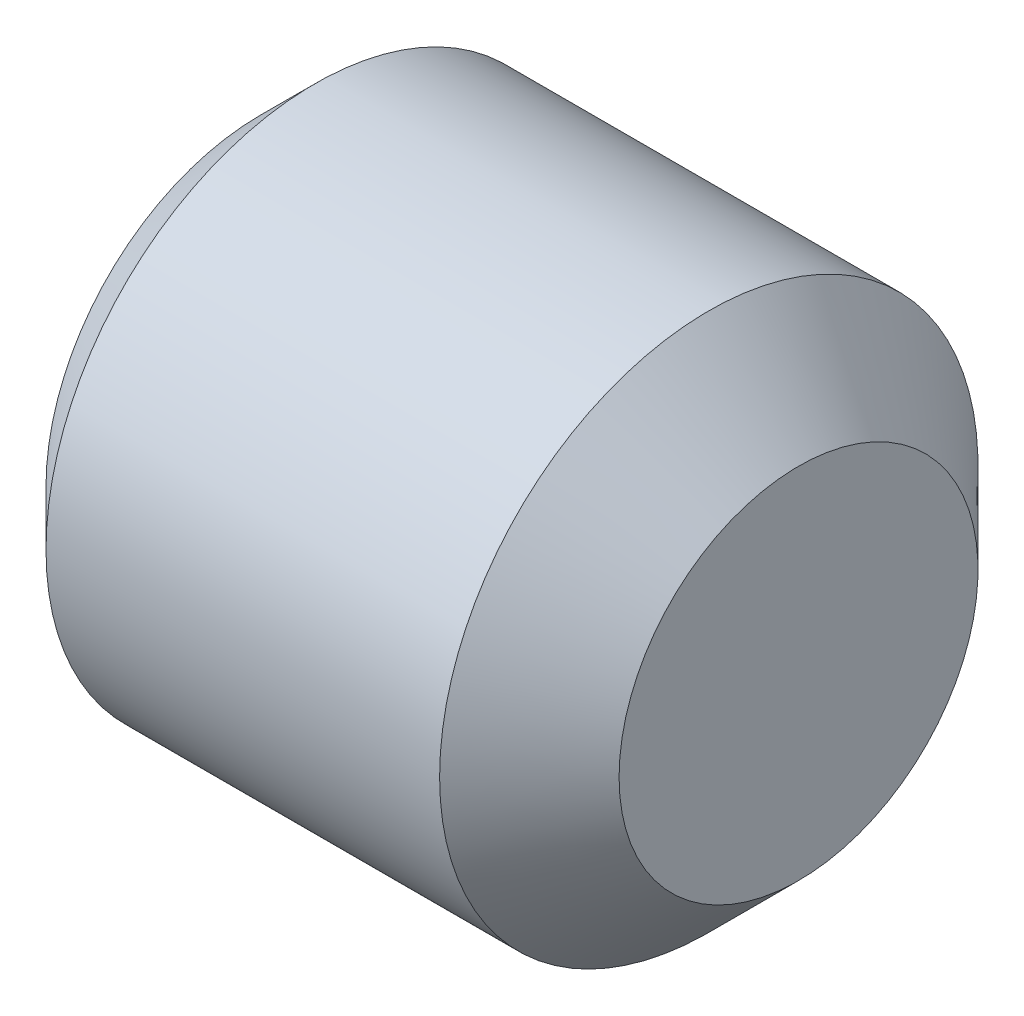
ISO-10303-21;
HEADER;
FILE_DESCRIPTION(('STEP AP214'),'2;1');
FILE_NAME('part.step','',(''),(''),'','','');
FILE_SCHEMA(('AUTOMOTIVE_DESIGN { 1 0 10303 214 1 1 1 1 }'));
ENDSEC;
DATA;
#1=APPLICATION_CONTEXT('core data for automotive mechanical design processes');
#2=APPLICATION_PROTOCOL_DEFINITION('international standard','automotive_design',2000,#1);
#3=PRODUCT_CONTEXT('',#1,'mechanical');
#4=PRODUCT('Part','Part','',(#3));
#5=PRODUCT_RELATED_PRODUCT_CATEGORY('part','',(#4));
#6=PRODUCT_DEFINITION_FORMATION('','',#4);
#7=PRODUCT_DEFINITION_CONTEXT('part definition',#1,'design');
#8=PRODUCT_DEFINITION('design','',#6,#7);
#9=PRODUCT_DEFINITION_SHAPE('','',#8);
#10=(LENGTH_UNIT() NAMED_UNIT(*) SI_UNIT(.MILLI.,.METRE.));
#11=(NAMED_UNIT(*) PLANE_ANGLE_UNIT() SI_UNIT($,.RADIAN.));
#12=(NAMED_UNIT(*) SI_UNIT($,.STERADIAN.) SOLID_ANGLE_UNIT());
#13=UNCERTAINTY_MEASURE_WITH_UNIT(LENGTH_MEASURE(1.E-05),#10,'distance_accuracy_value','');
#14=(GEOMETRIC_REPRESENTATION_CONTEXT(3) GLOBAL_UNCERTAINTY_ASSIGNED_CONTEXT((#13)) GLOBAL_UNIT_ASSIGNED_CONTEXT((#10,
#11,#12)) REPRESENTATION_CONTEXT('',''));
#15=CARTESIAN_POINT('',(0.,0.,0.));
#16=DIRECTION('',(0.,0.,1.));
#17=DIRECTION('',(1.,0.,0.));
#18=AXIS2_PLACEMENT_3D('',#15,#16,#17);
#19=CARTESIAN_POINT('',(-4.,0.,0.));
#20=DIRECTION('',(-1.,0.,0.));
#21=DIRECTION('',(0.,0.,1.));
#22=AXIS2_PLACEMENT_3D('',#19,#20,#21);
#23=PLANE('',#22);
#24=CARTESIAN_POINT('',(-4.00000000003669,0.,0.));
#25=DIRECTION('',(-1.,0.,0.));
#26=DIRECTION('',(0.,0.,1.));
#27=AXIS2_PLACEMENT_3D('',#24,#25,#26);
#28=CIRCLE('',#27,1.50000000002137);
#29=CARTESIAN_POINT('',(-4.00000000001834,-1.50000000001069,0.));
#30=VERTEX_POINT('',#29);
#31=CARTESIAN_POINT('',(-4.00000000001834,-0.750000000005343,-1.29903810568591));
#32=VERTEX_POINT('',#31);
#33=EDGE_CURVE('E100',#30,#32,#28,.F.);
#34=ORIENTED_EDGE('',*,*,#33,.T.);
#35=DIRECTION('',(0.,0.866025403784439,-0.5));
#36=VECTOR('',#35,1.);
#37=CARTESIAN_POINT('',(-4.,0.,-1.73205080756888));
#38=LINE('',#37,#36);
#39=CARTESIAN_POINT('',(-4.,-1.5,-0.86602540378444));
#40=VERTEX_POINT('',#39);
#41=EDGE_CURVE('E125',#32,#40,#38,.F.);
#42=ORIENTED_EDGE('',*,*,#41,.T.);
#43=DIRECTION('',(0.,0.,-1.));
#44=VECTOR('',#43,1.);
#45=CARTESIAN_POINT('',(-4.,-1.5,-0.866025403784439));
#46=LINE('',#45,#44);
#47=EDGE_CURVE('E128',#40,#30,#46,.F.);
#48=ORIENTED_EDGE('',*,*,#47,.T.);
#49=EDGE_LOOP('',(#34,#42,#48));
#50=FACE_BOUND('',#49,.T.);
#51=ADVANCED_FACE('F16',(#50),#23,.T.);
#52=CARTESIAN_POINT('',(-4.,0.,0.));
#53=DIRECTION('',(-1.,0.,0.));
#54=DIRECTION('',(0.,0.,1.));
#55=AXIS2_PLACEMENT_3D('',#52,#53,#54);
#56=PLANE('',#55);
#57=CARTESIAN_POINT('',(-4.00000000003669,0.,0.));
#58=DIRECTION('',(-1.,0.,0.));
#59=DIRECTION('',(0.,0.,1.));
#60=AXIS2_PLACEMENT_3D('',#57,#58,#59);
#61=CIRCLE('',#60,1.50000000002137);
#62=CARTESIAN_POINT('',(-4.00000000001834,0.750000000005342,-1.29903810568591));
#63=VERTEX_POINT('',#62);
#64=EDGE_CURVE('E121',#32,#63,#61,.F.);
#65=ORIENTED_EDGE('',*,*,#64,.T.);
#66=DIRECTION('',(0.,0.866025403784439,0.5));
#67=VECTOR('',#66,1.);
#68=CARTESIAN_POINT('',(-4.,1.5,-0.866025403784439));
#69=LINE('',#68,#67);
#70=CARTESIAN_POINT('',(-4.,0.,-1.73205080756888));
#71=VERTEX_POINT('',#70);
#72=EDGE_CURVE('E181',#63,#71,#69,.F.);
#73=ORIENTED_EDGE('',*,*,#72,.T.);
#74=DIRECTION('',(0.,0.866025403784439,-0.5));
#75=VECTOR('',#74,1.);
#76=CARTESIAN_POINT('',(-4.,0.,-1.73205080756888));
#77=LINE('',#76,#75);
#78=EDGE_CURVE('E133',#71,#32,#77,.F.);
#79=ORIENTED_EDGE('',*,*,#78,.T.);
#80=EDGE_LOOP('',(#65,#73,#79));
#81=FACE_BOUND('',#80,.T.);
#82=ADVANCED_FACE('F380',(#81),#56,.T.);
#83=CARTESIAN_POINT('',(-4.,0.,-1.73205080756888));
#84=DIRECTION('',(0.,-0.5,-0.866025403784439));
#85=DIRECTION('',(0.,0.866025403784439,-0.5));
#86=AXIS2_PLACEMENT_3D('',#83,#84,#85);
#87=PLANE('',#86);
#88=DIRECTION('',(1.,0.,0.));
#89=VECTOR('',#88,1.);
#90=CARTESIAN_POINT('',(-4.,-1.5,-0.866025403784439));
#91=LINE('',#90,#89);
#92=CARTESIAN_POINT('',(-6.,-1.5,-0.86602540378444));
#93=VERTEX_POINT('',#92);
#94=EDGE_CURVE('E136',#93,#40,#91,.T.);
#95=ORIENTED_EDGE('',*,*,#94,.T.);
#96=ORIENTED_EDGE('',*,*,#41,.F.);
#97=ORIENTED_EDGE('',*,*,#78,.F.);
#98=DIRECTION('',(1.,0.,0.));
#99=VECTOR('',#98,1.);
#100=CARTESIAN_POINT('',(-4.,0.,-1.73205080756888));
#101=LINE('',#100,#99);
#102=CARTESIAN_POINT('',(-6.,0.,-1.73205080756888));
#103=VERTEX_POINT('',#102);
#104=EDGE_CURVE('E149',#71,#103,#101,.F.);
#105=ORIENTED_EDGE('',*,*,#104,.T.);
#106=DIRECTION('',(0.,0.866025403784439,-0.5));
#107=VECTOR('',#106,1.);
#108=CARTESIAN_POINT('',(-6.,0.,-1.73205080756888));
#109=LINE('',#108,#107);
#110=EDGE_CURVE('E137',#93,#103,#109,.T.);
#111=ORIENTED_EDGE('',*,*,#110,.F.);
#112=EDGE_LOOP('',(#95,#96,#97,#105,#111));
#113=FACE_BOUND('',#112,.T.);
#114=ADVANCED_FACE('F131',(#113),#87,.F.);
#115=CARTESIAN_POINT('',(-4.,-1.5,-0.866025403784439));
#116=DIRECTION('',(0.,-1.,0.));
#117=DIRECTION('',(0.,0.,-1.));
#118=AXIS2_PLACEMENT_3D('',#115,#116,#117);
#119=PLANE('',#118);
#120=DIRECTION('',(1.,0.,0.));
#121=VECTOR('',#120,1.);
#122=CARTESIAN_POINT('',(-4.,-1.5,0.866025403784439));
#123=LINE('',#122,#121);
#124=CARTESIAN_POINT('',(-6.,-1.5,0.866025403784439));
#125=VERTEX_POINT('',#124);
#126=CARTESIAN_POINT('',(-4.,-1.5,0.866025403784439));
#127=VERTEX_POINT('',#126);
#128=EDGE_CURVE('E90',#125,#127,#123,.T.);
#129=ORIENTED_EDGE('',*,*,#128,.T.);
#130=DIRECTION('',(0.,0.,1.));
#131=VECTOR('',#130,1.);
#132=CARTESIAN_POINT('',(-4.,-1.5,0.));
#133=LINE('',#132,#131);
#134=EDGE_CURVE('E88',#30,#127,#133,.T.);
#135=ORIENTED_EDGE('',*,*,#134,.F.);
#136=ORIENTED_EDGE('',*,*,#47,.F.);
#137=ORIENTED_EDGE('',*,*,#94,.F.);
#138=DIRECTION('',(0.,0.,-1.));
#139=VECTOR('',#138,1.);
#140=CARTESIAN_POINT('',(-6.,-1.5,-0.866025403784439));
#141=LINE('',#140,#139);
#142=EDGE_CURVE('E195',#125,#93,#141,.T.);
#143=ORIENTED_EDGE('',*,*,#142,.F.);
#144=EDGE_LOOP('',(#129,#135,#136,#137,#143));
#145=FACE_BOUND('',#144,.T.);
#146=ADVANCED_FACE('F240',(#145),#119,.F.);
#147=CARTESIAN_POINT('',(-4.,0.,0.));
#148=DIRECTION('',(-1.,0.,0.));
#149=DIRECTION('',(0.,0.,1.));
#150=AXIS2_PLACEMENT_3D('',#147,#148,#149);
#151=PLANE('',#150);
#152=CARTESIAN_POINT('',(-4.00000000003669,0.,0.));
#153=DIRECTION('',(-1.,0.,0.));
#154=DIRECTION('',(0.,0.,1.));
#155=AXIS2_PLACEMENT_3D('',#152,#153,#154);
#156=CIRCLE('',#155,1.50000000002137);
#157=CARTESIAN_POINT('',(-4.00000000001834,-0.750000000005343,1.29903810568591));
#158=VERTEX_POINT('',#157);
#159=EDGE_CURVE('E19',#158,#30,#156,.F.);
#160=ORIENTED_EDGE('',*,*,#159,.T.);
#161=ORIENTED_EDGE('',*,*,#134,.T.);
#162=DIRECTION('',(0.,-0.866025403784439,-0.5));
#163=VECTOR('',#162,1.);
#164=CARTESIAN_POINT('',(-4.,-1.5,0.866025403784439));
#165=LINE('',#164,#163);
#166=EDGE_CURVE('E83',#127,#158,#165,.F.);
#167=ORIENTED_EDGE('',*,*,#166,.T.);
#168=EDGE_LOOP('',(#160,#161,#167));
#169=FACE_BOUND('',#168,.T.);
#170=ADVANCED_FACE('F85',(#169),#151,.T.);
#171=CARTESIAN_POINT('',(-3.99999999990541,0.,0.));
#172=DIRECTION('',(-1.,0.,0.));
#173=DIRECTION('',(0.,0.,1.));
#174=AXIS2_PLACEMENT_3D('',#171,#172,#173);
#175=CONICAL_SURFACE('',#174,1.499999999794,1.04719755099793);
#176=CARTESIAN_POINT('',(-3.13397459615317,0.,-1.13686837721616E-10));
#177=VERTEX_POINT('',#176);
#178=VERTEX_LOOP('',#177);
#179=FACE_BOUND('',#178,.T.);
#180=CARTESIAN_POINT('',(-4.00000000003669,0.,0.));
#181=DIRECTION('',(-1.,0.,0.));
#182=DIRECTION('',(0.,0.,1.));
#183=AXIS2_PLACEMENT_3D('',#180,#181,#182);
#184=CIRCLE('',#183,1.50000000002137);
#185=CARTESIAN_POINT('',(-4.00000000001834,1.50000000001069,0.));
#186=VERTEX_POINT('',#185);
#187=EDGE_CURVE('E117',#63,#186,#184,.F.);
#188=ORIENTED_EDGE('',*,*,#187,.F.);
#189=ORIENTED_EDGE('',*,*,#64,.F.);
#190=ORIENTED_EDGE('',*,*,#33,.F.);
#191=ORIENTED_EDGE('',*,*,#159,.F.);
#192=CARTESIAN_POINT('',(-4.00000000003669,0.,0.));
#193=DIRECTION('',(-1.,0.,0.));
#194=DIRECTION('',(0.,0.,1.));
#195=AXIS2_PLACEMENT_3D('',#192,#193,#194);
#196=CIRCLE('',#195,1.50000000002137);
#197=CARTESIAN_POINT('',(-4.00000000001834,0.750000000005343,1.29903810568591));
#198=VERTEX_POINT('',#197);
#199=EDGE_CURVE('E96',#198,#158,#196,.F.);
#200=ORIENTED_EDGE('',*,*,#199,.F.);
#201=CARTESIAN_POINT('',(-4.00000000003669,0.,0.));
#202=DIRECTION('',(-1.,0.,0.));
#203=DIRECTION('',(0.,0.,1.));
#204=AXIS2_PLACEMENT_3D('',#201,#202,#203);
#205=CIRCLE('',#204,1.50000000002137);
#206=EDGE_CURVE('E107',#186,#198,#205,.F.);
#207=ORIENTED_EDGE('',*,*,#206,.F.);
#208=EDGE_LOOP('',(#188,#189,#190,#191,#200,#207));
#209=FACE_BOUND('',#208,.T.);
#210=ADVANCED_FACE('F94',(#179,#209),#175,.F.);
#211=CARTESIAN_POINT('',(-4.,0.,0.));
#212=DIRECTION('',(-1.,0.,0.));
#213=DIRECTION('',(0.,0.,1.));
#214=AXIS2_PLACEMENT_3D('',#211,#212,#213);
#215=PLANE('',#214);
#216=ORIENTED_EDGE('',*,*,#187,.T.);
#217=DIRECTION('',(0.,0.,1.));
#218=VECTOR('',#217,1.);
#219=CARTESIAN_POINT('',(-4.,1.5,0.866025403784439));
#220=LINE('',#219,#218);
#221=CARTESIAN_POINT('',(-4.,1.5,-0.866025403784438));
#222=VERTEX_POINT('',#221);
#223=EDGE_CURVE('E173',#186,#222,#220,.F.);
#224=ORIENTED_EDGE('',*,*,#223,.T.);
#225=DIRECTION('',(0.,0.866025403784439,0.5));
#226=VECTOR('',#225,1.);
#227=CARTESIAN_POINT('',(-4.,1.5,-0.866025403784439));
#228=LINE('',#227,#226);
#229=EDGE_CURVE('E120',#222,#63,#228,.F.);
#230=ORIENTED_EDGE('',*,*,#229,.T.);
#231=EDGE_LOOP('',(#216,#224,#230));
#232=FACE_BOUND('',#231,.T.);
#233=ADVANCED_FACE('F231',(#232),#215,.T.);
#234=CARTESIAN_POINT('',(-4.,1.5,-0.866025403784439));
#235=DIRECTION('',(0.,0.5,-0.866025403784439));
#236=DIRECTION('',(0.,0.866025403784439,0.5));
#237=AXIS2_PLACEMENT_3D('',#234,#235,#236);
#238=PLANE('',#237);
#239=ORIENTED_EDGE('',*,*,#104,.F.);
#240=ORIENTED_EDGE('',*,*,#72,.F.);
#241=ORIENTED_EDGE('',*,*,#229,.F.);
#242=DIRECTION('',(1.,0.,0.));
#243=VECTOR('',#242,1.);
#244=CARTESIAN_POINT('',(-4.,1.5,-0.866025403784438));
#245=LINE('',#244,#243);
#246=CARTESIAN_POINT('',(-6.,1.5,-0.866025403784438));
#247=VERTEX_POINT('',#246);
#248=EDGE_CURVE('E175',#222,#247,#245,.F.);
#249=ORIENTED_EDGE('',*,*,#248,.T.);
#250=DIRECTION('',(0.,0.866025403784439,0.5));
#251=VECTOR('',#250,1.);
#252=CARTESIAN_POINT('',(-6.,1.5,-0.866025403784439));
#253=LINE('',#252,#251);
#254=EDGE_CURVE('E146',#103,#247,#253,.T.);
#255=ORIENTED_EDGE('',*,*,#254,.F.);
#256=EDGE_LOOP('',(#239,#240,#241,#249,#255));
#257=FACE_BOUND('',#256,.T.);
#258=ADVANCED_FACE('F218',(#257),#238,.F.);
#259=CARTESIAN_POINT('',(-4.,-1.5,0.866025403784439));
#260=DIRECTION('',(0.,-0.5,0.866025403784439));
#261=DIRECTION('',(0.,-0.866025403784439,-0.5));
#262=AXIS2_PLACEMENT_3D('',#259,#260,#261);
#263=PLANE('',#262);
#264=DIRECTION('',(1.,0.,0.));
#265=VECTOR('',#264,1.);
#266=CARTESIAN_POINT('',(-4.,0.,1.73205080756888));
#267=LINE('',#266,#265);
#268=CARTESIAN_POINT('',(-6.,0.,1.73205080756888));
#269=VERTEX_POINT('',#268);
#270=CARTESIAN_POINT('',(-4.,0.,1.73205080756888));
#271=VERTEX_POINT('',#270);
#272=EDGE_CURVE('E104',#269,#271,#267,.T.);
#273=ORIENTED_EDGE('',*,*,#272,.T.);
#274=DIRECTION('',(0.,0.866025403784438,0.500000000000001));
#275=VECTOR('',#274,1.);
#276=CARTESIAN_POINT('',(-4.,-0.75,1.29903810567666));
#277=LINE('',#276,#275);
#278=EDGE_CURVE('E102',#158,#271,#277,.T.);
#279=ORIENTED_EDGE('',*,*,#278,.F.);
#280=ORIENTED_EDGE('',*,*,#166,.F.);
#281=ORIENTED_EDGE('',*,*,#128,.F.);
#282=DIRECTION('',(0.,-0.866025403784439,-0.5));
#283=VECTOR('',#282,1.);
#284=CARTESIAN_POINT('',(-6.,-1.5,0.866025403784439));
#285=LINE('',#284,#283);
#286=EDGE_CURVE('E34',#269,#125,#285,.T.);
#287=ORIENTED_EDGE('',*,*,#286,.F.);
#288=EDGE_LOOP('',(#273,#279,#280,#281,#287));
#289=FACE_BOUND('',#288,.T.);
#290=ADVANCED_FACE('F103',(#289),#263,.F.);
#291=CARTESIAN_POINT('',(-4.,0.,0.));
#292=DIRECTION('',(-1.,0.,0.));
#293=DIRECTION('',(0.,0.,1.));
#294=AXIS2_PLACEMENT_3D('',#291,#292,#293);
#295=PLANE('',#294);
#296=ORIENTED_EDGE('',*,*,#199,.T.);
#297=ORIENTED_EDGE('',*,*,#278,.T.);
#298=DIRECTION('',(0.,-0.866025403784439,0.5));
#299=VECTOR('',#298,1.);
#300=CARTESIAN_POINT('',(-4.,0.,1.73205080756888));
#301=LINE('',#300,#299);
#302=EDGE_CURVE('E110',#271,#198,#301,.F.);
#303=ORIENTED_EDGE('',*,*,#302,.T.);
#304=EDGE_LOOP('',(#296,#297,#303));
#305=FACE_BOUND('',#304,.T.);
#306=ADVANCED_FACE('F109',(#305),#295,.T.);
#307=CARTESIAN_POINT('',(-4.,0.,0.));
#308=DIRECTION('',(-1.,0.,0.));
#309=DIRECTION('',(0.,0.,1.));
#310=AXIS2_PLACEMENT_3D('',#307,#308,#309);
#311=PLANE('',#310);
#312=ORIENTED_EDGE('',*,*,#206,.T.);
#313=DIRECTION('',(0.,-0.866025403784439,0.5));
#314=VECTOR('',#313,1.);
#315=CARTESIAN_POINT('',(-4.,0.,1.73205080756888));
#316=LINE('',#315,#314);
#317=CARTESIAN_POINT('',(-4.,1.5,0.866025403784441));
#318=VERTEX_POINT('',#317);
#319=EDGE_CURVE('E166',#198,#318,#316,.F.);
#320=ORIENTED_EDGE('',*,*,#319,.T.);
#321=DIRECTION('',(0.,0.,1.));
#322=VECTOR('',#321,1.);
#323=CARTESIAN_POINT('',(-4.,1.5,0.866025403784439));
#324=LINE('',#323,#322);
#325=EDGE_CURVE('E176',#318,#186,#324,.F.);
#326=ORIENTED_EDGE('',*,*,#325,.T.);
#327=EDGE_LOOP('',(#312,#320,#326));
#328=FACE_BOUND('',#327,.T.);
#329=ADVANCED_FACE('F270',(#328),#311,.T.);
#330=CARTESIAN_POINT('',(-4.,1.5,0.866025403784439));
#331=DIRECTION('',(0.,1.,0.));
#332=DIRECTION('',(0.,0.,1.));
#333=AXIS2_PLACEMENT_3D('',#330,#331,#332);
#334=PLANE('',#333);
#335=DIRECTION('',(0.,0.,1.));
#336=VECTOR('',#335,1.);
#337=CARTESIAN_POINT('',(-6.,1.5,0.866025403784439));
#338=LINE('',#337,#336);
#339=CARTESIAN_POINT('',(-6.,1.5,0.86602540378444));
#340=VERTEX_POINT('',#339);
#341=EDGE_CURVE('E186',#247,#340,#338,.T.);
#342=ORIENTED_EDGE('',*,*,#341,.F.);
#343=ORIENTED_EDGE('',*,*,#248,.F.);
#344=ORIENTED_EDGE('',*,*,#223,.F.);
#345=ORIENTED_EDGE('',*,*,#325,.F.);
#346=DIRECTION('',(1.,0.,0.));
#347=VECTOR('',#346,1.);
#348=CARTESIAN_POINT('',(-4.,1.5,0.866025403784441));
#349=LINE('',#348,#347);
#350=EDGE_CURVE('E160',#318,#340,#349,.F.);
#351=ORIENTED_EDGE('',*,*,#350,.T.);
#352=EDGE_LOOP('',(#342,#343,#344,#345,#351));
#353=FACE_BOUND('',#352,.T.);
#354=ADVANCED_FACE('F267',(#353),#334,.F.);
#355=CARTESIAN_POINT('',(-4.,0.,1.73205080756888));
#356=DIRECTION('',(0.,0.5,0.866025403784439));
#357=DIRECTION('',(0.,-0.866025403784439,0.5));
#358=AXIS2_PLACEMENT_3D('',#355,#356,#357);
#359=PLANE('',#358);
#360=ORIENTED_EDGE('',*,*,#350,.F.);
#361=ORIENTED_EDGE('',*,*,#319,.F.);
#362=ORIENTED_EDGE('',*,*,#302,.F.);
#363=ORIENTED_EDGE('',*,*,#272,.F.);
#364=DIRECTION('',(0.,0.866025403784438,-0.500000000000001));
#365=VECTOR('',#364,1.);
#366=CARTESIAN_POINT('',(-6.,0.,1.73205080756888));
#367=LINE('',#366,#365);
#368=EDGE_CURVE('E156',#269,#340,#367,.T.);
#369=ORIENTED_EDGE('',*,*,#368,.T.);
#370=EDGE_LOOP('',(#360,#361,#362,#363,#369));
#371=FACE_BOUND('',#370,.T.);
#372=ADVANCED_FACE('F263',(#371),#359,.F.);
#373=CARTESIAN_POINT('',(0.,2.,0.));
#374=DIRECTION('',(-1.,0.,0.));
#375=DIRECTION('',(0.,0.,1.));
#376=AXIS2_PLACEMENT_3D('',#373,#374,#375);
#377=PLANE('',#376);
#378=CARTESIAN_POINT('',(-5.6843418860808E-11,0.,0.));
#379=DIRECTION('',(-1.,0.,0.));
#380=DIRECTION('',(0.,0.,1.));
#381=AXIS2_PLACEMENT_3D('',#378,#379,#380);
#382=CIRCLE('',#381,2.00000000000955);
#383=CARTESIAN_POINT('',(-5.6843418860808E-11,0.,2.00000000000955));
#384=VERTEX_POINT('',#383);
#385=EDGE_CURVE('E154',#384,#384,#382,.T.);
#386=ORIENTED_EDGE('',*,*,#385,.F.);
#387=EDGE_LOOP('',(#386));
#388=FACE_BOUND('',#387,.T.);
#389=ADVANCED_FACE('F260',(#388),#377,.F.);
#390=CARTESIAN_POINT('',(-6.,0.,0.));
#391=DIRECTION('',(1.,0.,0.));
#392=DIRECTION('',(0.,0.,-1.));
#393=AXIS2_PLACEMENT_3D('',#390,#391,#392);
#394=PLANE('',#393);
#395=ORIENTED_EDGE('',*,*,#286,.T.);
#396=ORIENTED_EDGE('',*,*,#142,.T.);
#397=ORIENTED_EDGE('',*,*,#110,.T.);
#398=ORIENTED_EDGE('',*,*,#254,.T.);
#399=ORIENTED_EDGE('',*,*,#341,.T.);
#400=ORIENTED_EDGE('',*,*,#368,.F.);
#401=EDGE_LOOP('',(#395,#396,#397,#398,#399,#400));
#402=FACE_BOUND('',#401,.T.);
#403=CARTESIAN_POINT('',(-6.00000000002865,0.,0.));
#404=DIRECTION('',(1.,0.,0.));
#405=DIRECTION('',(0.,0.,-1.));
#406=AXIS2_PLACEMENT_3D('',#403,#404,#405);
#407=CIRCLE('',#406,2.38650000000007);
#408=CARTESIAN_POINT('',(-6.00000000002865,0.,-2.38650000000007));
#409=VERTEX_POINT('',#408);
#410=EDGE_CURVE('E152',#409,#409,#407,.T.);
#411=ORIENTED_EDGE('',*,*,#410,.F.);
#412=EDGE_LOOP('',(#411));
#413=FACE_BOUND('',#412,.T.);
#414=ADVANCED_FACE('F223',(#402,#413),#394,.F.);
#415=CARTESIAN_POINT('',(-0.999999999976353,0.,0.));
#416=DIRECTION('',(-1.,0.,0.));
#417=DIRECTION('',(0.,0.,1.));
#418=AXIS2_PLACEMENT_3D('',#415,#416,#417);
#419=CONICAL_SURFACE('',#418,2.99999999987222,0.785398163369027);
#420=CARTESIAN_POINT('',(-1.,0.,0.));
#421=DIRECTION('',(-1.,0.,0.));
#422=DIRECTION('',(0.,0.,1.));
#423=AXIS2_PLACEMENT_3D('',#420,#421,#422);
#424=CIRCLE('',#423,3.);
#425=CARTESIAN_POINT('',(-1.,0.,3.));
#426=VERTEX_POINT('',#425);
#427=EDGE_CURVE('E25',#426,#426,#424,.T.);
#428=ORIENTED_EDGE('',*,*,#427,.F.);
#429=EDGE_LOOP('',(#428));
#430=FACE_BOUND('',#429,.T.);
#431=ORIENTED_EDGE('',*,*,#385,.T.);
#432=EDGE_LOOP('',(#431));
#433=FACE_BOUND('',#432,.T.);
#434=ADVANCED_FACE('F250',(#430,#433),#419,.T.);
#435=CARTESIAN_POINT('',(-5.38649999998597,0.,0.));
#436=DIRECTION('',(1.,0.,0.));
#437=DIRECTION('',(0.,0.,-1.));
#438=AXIS2_PLACEMENT_3D('',#435,#436,#437);
#439=CONICAL_SURFACE('',#438,3.00000000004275,0.785398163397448);
#440=ORIENTED_EDGE('',*,*,#410,.T.);
#441=EDGE_LOOP('',(#440));
#442=FACE_BOUND('',#441,.T.);
#443=CARTESIAN_POINT('',(-5.3865,0.,0.));
#444=DIRECTION('',(-1.,0.,0.));
#445=DIRECTION('',(0.,0.,1.));
#446=AXIS2_PLACEMENT_3D('',#443,#444,#445);
#447=CIRCLE('',#446,3.);
#448=CARTESIAN_POINT('',(-5.3865,0.,3.));
#449=VERTEX_POINT('',#448);
#450=EDGE_CURVE('E11',#449,#449,#447,.F.);
#451=ORIENTED_EDGE('',*,*,#450,.F.);
#452=EDGE_LOOP('',(#451));
#453=FACE_BOUND('',#452,.T.);
#454=ADVANCED_FACE('F244',(#442,#453),#439,.T.);
#455=CARTESIAN_POINT('',(0.,0.,0.));
#456=DIRECTION('',(-1.,0.,0.));
#457=DIRECTION('',(0.,0.,1.));
#458=AXIS2_PLACEMENT_3D('',#455,#456,#457);
#459=CYLINDRICAL_SURFACE('',#458,3.);
#460=ORIENTED_EDGE('',*,*,#450,.T.);
#461=EDGE_LOOP('',(#460));
#462=FACE_BOUND('',#461,.T.);
#463=ORIENTED_EDGE('',*,*,#427,.T.);
#464=EDGE_LOOP('',(#463));
#465=FACE_BOUND('',#464,.T.);
#466=ADVANCED_FACE('F242',(#462,#465),#459,.T.);
#467=CLOSED_SHELL('',(#51,#82,#114,#146,#170,#210,#233,#258,#290,#306,#329,#354,#372,#389,#414,
#434,#454,#466));
#468=MANIFOLD_SOLID_BREP('B1',#467);
#469=ADVANCED_BREP_SHAPE_REPRESENTATION('',(#18,#468),#14);
#470=SHAPE_DEFINITION_REPRESENTATION(#9,#469);
ENDSEC;
END-ISO-10303-21;
